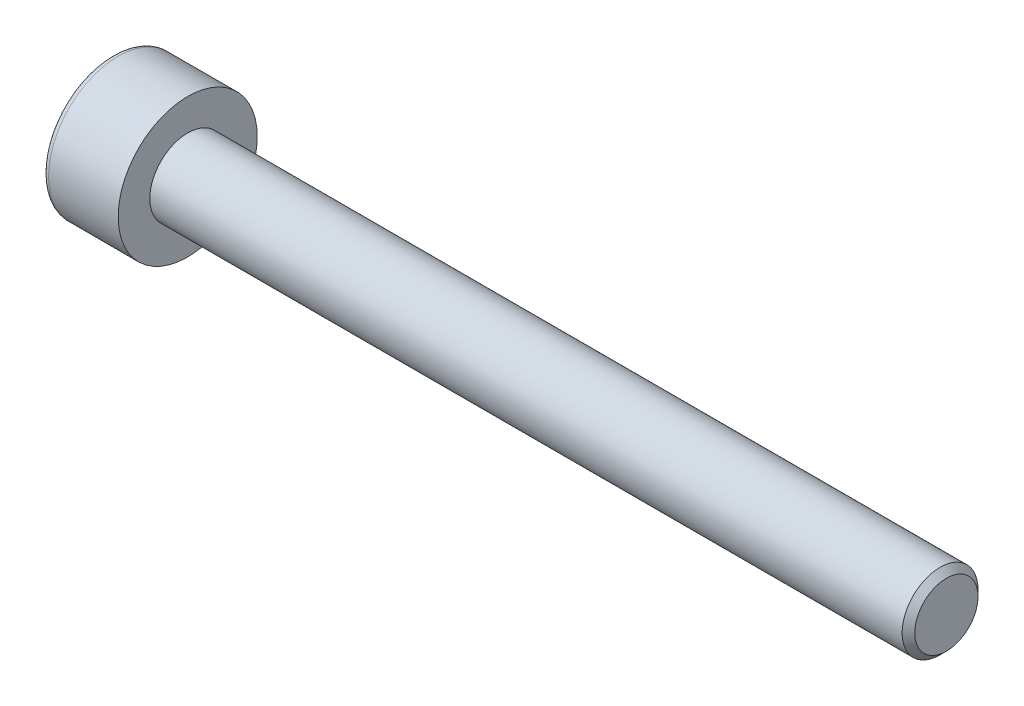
from build123d import *

# Parameters (mm, degrees)
CHANFREIN_TIGE_SIZE     = 0.25
CONG_TETE_R             = 0.25
ENL_V_MAT_EXTRU_1_DEPTH = 1.7


with BuildPart() as part:
    # Esquisse1 → Base-R_volution (revolve)
    with BuildSketch(Plane.XY, mode=Mode.PRIVATE) as base_r_volution_sk:
        Polygon((0, 1.5), (0, 2.75), (-3, 2.75), (-3, 0), (30, 0), (30, 1.5), align=None)
    revolve(base_r_volution_sk.sketch.rotate(Axis((12.501307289, 0, 0), (-1, 0, 0)), 90), axis=Axis((12.501307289, 0, 0), (-1, 0, 0)))

    # Chanfrein tige
    chanfrein_tige_edges = [part.edges().sort_by_distance(p)[0] for p in [
        (30, 0, 1.5),
    ]]
    chamfer(chanfrein_tige_edges, length=CHANFREIN_TIGE_SIZE)

    # Cong_ tete
    cong_tete_edges = [part.edges().sort_by_distance(p)[0] for p in [
        (-3, 0, 2.75),
    ]]
    fillet(cong_tete_edges, radius=CONG_TETE_R)

    # Esquisse2 → Enl_v. mat.-Extru.1 (cut)
    with BuildSketch(Plane.ZY.offset(3)):
        Polygon((1.443375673, 0), (0.721687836, 1.25), (-0.721687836, 1.25), (-1.443375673, 0), (-0.721687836, -1.25), (0.721687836, -1.25), align=None)
    extrude(amount=-ENL_V_MAT_EXTRU_1_DEPTH, mode=Mode.SUBTRACT)


solid = part.part
